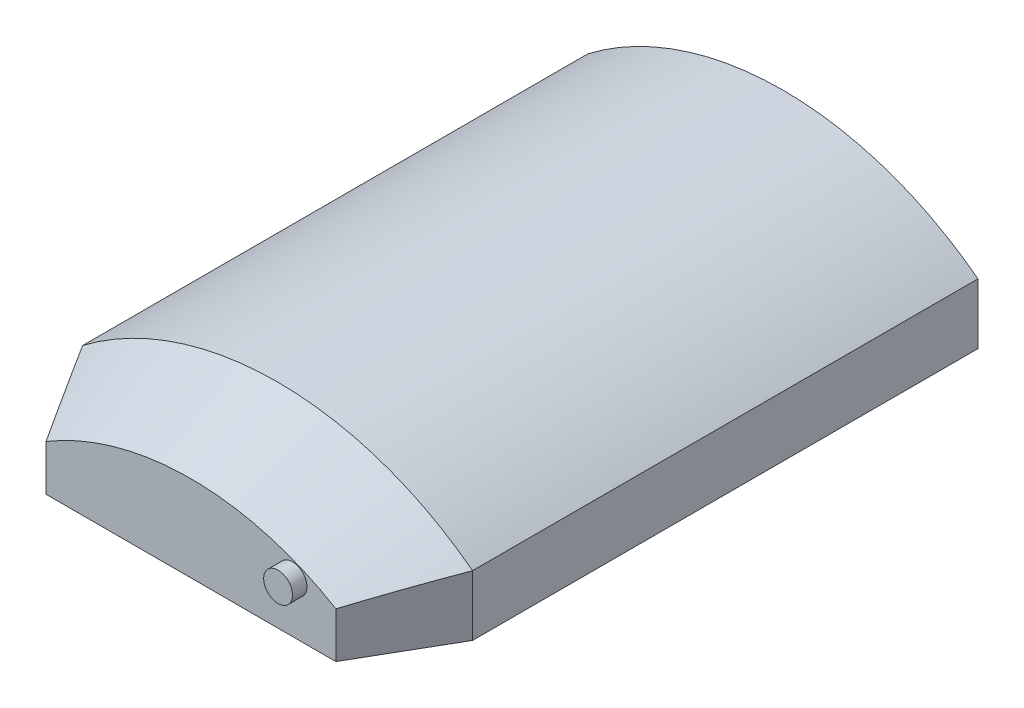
ISO-10303-21;
HEADER;
FILE_DESCRIPTION(('STEP AP214'),'2;1');
FILE_NAME('part.step','',(''),(''),'','','');
FILE_SCHEMA(('AUTOMOTIVE_DESIGN { 1 0 10303 214 1 1 1 1 }'));
ENDSEC;
DATA;
#1=APPLICATION_CONTEXT('core data for automotive mechanical design processes');
#2=APPLICATION_PROTOCOL_DEFINITION('international standard','automotive_design',2000,#1);
#3=PRODUCT_CONTEXT('',#1,'mechanical');
#4=PRODUCT('Part','Part','',(#3));
#5=PRODUCT_RELATED_PRODUCT_CATEGORY('part','',(#4));
#6=PRODUCT_DEFINITION_FORMATION('','',#4);
#7=PRODUCT_DEFINITION_CONTEXT('part definition',#1,'design');
#8=PRODUCT_DEFINITION('design','',#6,#7);
#9=PRODUCT_DEFINITION_SHAPE('','',#8);
#10=(LENGTH_UNIT() NAMED_UNIT(*) SI_UNIT(.MILLI.,.METRE.));
#11=(NAMED_UNIT(*) PLANE_ANGLE_UNIT() SI_UNIT($,.RADIAN.));
#12=(NAMED_UNIT(*) SI_UNIT($,.STERADIAN.) SOLID_ANGLE_UNIT());
#13=UNCERTAINTY_MEASURE_WITH_UNIT(LENGTH_MEASURE(1.E-05),#10,'distance_accuracy_value','');
#14=(GEOMETRIC_REPRESENTATION_CONTEXT(3) GLOBAL_UNCERTAINTY_ASSIGNED_CONTEXT((#13)) GLOBAL_UNIT_ASSIGNED_CONTEXT((#10,
#11,#12)) REPRESENTATION_CONTEXT('',''));
#15=CARTESIAN_POINT('',(0.,0.,0.));
#16=DIRECTION('',(0.,0.,1.));
#17=DIRECTION('',(1.,0.,0.));
#18=AXIS2_PLACEMENT_3D('',#15,#16,#17);
#19=CARTESIAN_POINT('',(0.,0.,260.35));
#20=DIRECTION('',(0.,0.,-1.));
#21=DIRECTION('',(-1.,0.,0.));
#22=AXIS2_PLACEMENT_3D('',#19,#20,#21);
#23=CYLINDRICAL_SURFACE('',#22,141.2875);
#24=DIRECTION('',(0.,0.,-1.));
#25=VECTOR('',#24,1.);
#26=CARTESIAN_POINT('',(-85.725,112.309314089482,260.35));
#27=LINE('',#26,#25);
#28=CARTESIAN_POINT('',(-85.725,112.309314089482,222.25));
#29=VERTEX_POINT('',#28);
#30=CARTESIAN_POINT('',(-85.725,112.309314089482,0.));
#31=VERTEX_POINT('',#30);
#32=EDGE_CURVE('E144',#29,#31,#27,.T.);
#33=ORIENTED_EDGE('',*,*,#32,.F.);
#34=CARTESIAN_POINT('',(0.,0.,222.25));
#35=DIRECTION('',(0.,0.,1.));
#36=DIRECTION('',(1.,0.,0.));
#37=AXIS2_PLACEMENT_3D('',#34,#35,#36);
#38=CIRCLE('',#37,141.2875);
#39=CARTESIAN_POINT('',(85.725,112.309314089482,222.25));
#40=VERTEX_POINT('',#39);
#41=EDGE_CURVE('E149',#29,#40,#38,.F.);
#42=ORIENTED_EDGE('',*,*,#41,.T.);
#43=DIRECTION('',(0.,0.,-1.));
#44=VECTOR('',#43,1.);
#45=CARTESIAN_POINT('',(85.725,112.309314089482,260.35));
#46=LINE('',#45,#44);
#47=CARTESIAN_POINT('',(85.725,112.309314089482,0.));
#48=VERTEX_POINT('',#47);
#49=EDGE_CURVE('E115',#40,#48,#46,.T.);
#50=ORIENTED_EDGE('',*,*,#49,.T.);
#51=CARTESIAN_POINT('',(0.,0.,0.));
#52=DIRECTION('',(0.,0.,1.));
#53=DIRECTION('',(1.,0.,0.));
#54=AXIS2_PLACEMENT_3D('',#51,#52,#53);
#55=CIRCLE('',#54,141.2875);
#56=EDGE_CURVE('E129',#48,#31,#55,.T.);
#57=ORIENTED_EDGE('',*,*,#56,.T.);
#58=EDGE_LOOP('',(#33,#42,#50,#57));
#59=FACE_BOUND('',#58,.T.);
#60=ADVANCED_FACE('F42',(#59),#23,.T.);
#61=CARTESIAN_POINT('',(-85.725,112.309314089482,260.35));
#62=DIRECTION('',(1.,0.,0.));
#63=DIRECTION('',(0.,0.,-1.));
#64=AXIS2_PLACEMENT_3D('',#61,#62,#63);
#65=PLANE('',#64);
#66=DIRECTION('',(0.,0.,-1.));
#67=VECTOR('',#66,1.);
#68=CARTESIAN_POINT('',(-85.725,85.725,260.35));
#69=LINE('',#68,#67);
#70=CARTESIAN_POINT('',(-85.725,85.725,222.25));
#71=VERTEX_POINT('',#70);
#72=CARTESIAN_POINT('',(-85.725,85.725,0.));
#73=VERTEX_POINT('',#72);
#74=EDGE_CURVE('E141',#71,#73,#69,.T.);
#75=ORIENTED_EDGE('',*,*,#74,.F.);
#76=DIRECTION('',(0.,-1.,0.));
#77=VECTOR('',#76,1.);
#78=CARTESIAN_POINT('',(-85.725,141.2875,222.25));
#79=LINE('',#78,#77);
#80=EDGE_CURVE('E127',#29,#71,#79,.T.);
#81=ORIENTED_EDGE('',*,*,#80,.F.);
#82=ORIENTED_EDGE('',*,*,#32,.T.);
#83=DIRECTION('',(0.,-1.,0.));
#84=VECTOR('',#83,1.);
#85=CARTESIAN_POINT('',(-85.725,112.309314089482,0.));
#86=LINE('',#85,#84);
#87=EDGE_CURVE('E133',#31,#73,#86,.T.);
#88=ORIENTED_EDGE('',*,*,#87,.T.);
#89=EDGE_LOOP('',(#75,#81,#82,#88));
#90=FACE_BOUND('',#89,.T.);
#91=ADVANCED_FACE('F163',(#90),#65,.F.);
#92=CARTESIAN_POINT('',(-85.725,85.725,260.35));
#93=DIRECTION('',(0.,1.,0.));
#94=DIRECTION('',(0.,0.,1.));
#95=AXIS2_PLACEMENT_3D('',#92,#93,#94);
#96=PLANE('',#95);
#97=DIRECTION('',(0.,0.,-1.));
#98=VECTOR('',#97,1.);
#99=CARTESIAN_POINT('',(85.725,85.725,260.35));
#100=LINE('',#99,#98);
#101=CARTESIAN_POINT('',(85.725,85.725,222.25));
#102=VERTEX_POINT('',#101);
#103=CARTESIAN_POINT('',(85.725,85.725,0.));
#104=VERTEX_POINT('',#103);
#105=EDGE_CURVE('E108',#102,#104,#100,.T.);
#106=ORIENTED_EDGE('',*,*,#105,.F.);
#107=DIRECTION('',(0.499999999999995,0.,-0.866025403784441));
#108=VECTOR('',#107,1.);
#109=CARTESIAN_POINT('',(85.725,85.725,222.25));
#110=LINE('',#109,#108);
#111=CARTESIAN_POINT('',(63.7279547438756,85.725,260.35));
#112=VERTEX_POINT('',#111);
#113=EDGE_CURVE('E97',#112,#102,#110,.T.);
#114=ORIENTED_EDGE('',*,*,#113,.F.);
#115=DIRECTION('',(1.,0.,0.));
#116=VECTOR('',#115,1.);
#117=CARTESIAN_POINT('',(-85.725,85.725,260.35));
#118=LINE('',#117,#116);
#119=CARTESIAN_POINT('',(-63.7279547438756,85.725,260.35));
#120=VERTEX_POINT('',#119);
#121=EDGE_CURVE('E106',#120,#112,#118,.T.);
#122=ORIENTED_EDGE('',*,*,#121,.F.);
#123=DIRECTION('',(0.499999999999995,0.,0.866025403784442));
#124=VECTOR('',#123,1.);
#125=CARTESIAN_POINT('',(-63.7279547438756,85.725,260.35));
#126=LINE('',#125,#124);
#127=EDGE_CURVE('E166',#71,#120,#126,.T.);
#128=ORIENTED_EDGE('',*,*,#127,.F.);
#129=ORIENTED_EDGE('',*,*,#74,.T.);
#130=DIRECTION('',(1.,0.,0.));
#131=VECTOR('',#130,1.);
#132=CARTESIAN_POINT('',(-85.725,85.725,0.));
#133=LINE('',#132,#131);
#134=EDGE_CURVE('E123',#73,#104,#133,.T.);
#135=ORIENTED_EDGE('',*,*,#134,.T.);
#136=EDGE_LOOP('',(#106,#114,#122,#128,#129,#135));
#137=FACE_BOUND('',#136,.T.);
#138=ADVANCED_FACE('F104',(#137),#96,.F.);
#139=CARTESIAN_POINT('',(85.725,85.725,260.35));
#140=DIRECTION('',(-1.,0.,0.));
#141=DIRECTION('',(0.,0.,1.));
#142=AXIS2_PLACEMENT_3D('',#139,#140,#141);
#143=PLANE('',#142);
#144=ORIENTED_EDGE('',*,*,#49,.F.);
#145=DIRECTION('',(0.,-1.,0.));
#146=VECTOR('',#145,1.);
#147=CARTESIAN_POINT('',(85.725,141.2875,222.25));
#148=LINE('',#147,#146);
#149=EDGE_CURVE('E65',#40,#102,#148,.T.);
#150=ORIENTED_EDGE('',*,*,#149,.T.);
#151=ORIENTED_EDGE('',*,*,#105,.T.);
#152=DIRECTION('',(0.,1.,0.));
#153=VECTOR('',#152,1.);
#154=CARTESIAN_POINT('',(85.725,85.725,0.));
#155=LINE('',#154,#153);
#156=EDGE_CURVE('E116',#104,#48,#155,.T.);
#157=ORIENTED_EDGE('',*,*,#156,.T.);
#158=EDGE_LOOP('',(#144,#150,#151,#157));
#159=FACE_BOUND('',#158,.T.);
#160=ADVANCED_FACE('F187',(#159),#143,.F.);
#161=CARTESIAN_POINT('',(0.,0.,260.35));
#162=DIRECTION('',(0.,0.,1.));
#163=DIRECTION('',(1.,0.,0.));
#164=AXIS2_PLACEMENT_3D('',#161,#162,#163);
#165=PLANE('',#164);
#166=CARTESIAN_POINT('',(44.67352,107.852355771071,260.35));
#167=DIRECTION('',(0.,0.,1.));
#168=DIRECTION('',(1.,0.,0.));
#169=AXIS2_PLACEMENT_3D('',#166,#167,#168);
#170=CIRCLE('',#169,6.35);
#171=CARTESIAN_POINT('',(51.02352,107.852355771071,260.35));
#172=VERTEX_POINT('',#171);
#173=EDGE_CURVE('E207',#172,#172,#170,.T.);
#174=ORIENTED_EDGE('',*,*,#173,.F.);
#175=EDGE_LOOP('',(#174));
#176=FACE_BOUND('',#175,.T.);
#177=DIRECTION('',(0.,-1.,0.));
#178=VECTOR('',#177,1.);
#179=CARTESIAN_POINT('',(63.7279547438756,141.2875,260.35));
#180=LINE('',#179,#178);
#181=CARTESIAN_POINT('',(63.7279547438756,105.812235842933,260.35));
#182=VERTEX_POINT('',#181);
#183=EDGE_CURVE('E94',#182,#112,#180,.T.);
#184=ORIENTED_EDGE('',*,*,#183,.F.);
#185=CARTESIAN_POINT('',(0.,0.,260.35));
#186=DIRECTION('',(0.,0.,1.));
#187=DIRECTION('',(1.,0.,0.));
#188=AXIS2_PLACEMENT_3D('',#185,#186,#187);
#189=CIRCLE('',#188,123.521178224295);
#190=CARTESIAN_POINT('',(-63.7279547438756,105.812235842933,260.35));
#191=VERTEX_POINT('',#190);
#192=EDGE_CURVE('E58',#182,#191,#189,.T.);
#193=ORIENTED_EDGE('',*,*,#192,.T.);
#194=DIRECTION('',(0.,-1.,0.));
#195=VECTOR('',#194,1.);
#196=CARTESIAN_POINT('',(-63.7279547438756,141.2875,260.35));
#197=LINE('',#196,#195);
#198=EDGE_CURVE('E113',#191,#120,#197,.T.);
#199=ORIENTED_EDGE('',*,*,#198,.T.);
#200=ORIENTED_EDGE('',*,*,#121,.T.);
#201=EDGE_LOOP('',(#184,#193,#199,#200));
#202=FACE_BOUND('',#201,.T.);
#203=ADVANCED_FACE('F112',(#176,#202),#165,.T.);
#204=CARTESIAN_POINT('',(0.,0.,0.));
#205=DIRECTION('',(0.,0.,1.));
#206=DIRECTION('',(1.,0.,0.));
#207=AXIS2_PLACEMENT_3D('',#204,#205,#206);
#208=PLANE('',#207);
#209=ORIENTED_EDGE('',*,*,#56,.F.);
#210=ORIENTED_EDGE('',*,*,#156,.F.);
#211=ORIENTED_EDGE('',*,*,#134,.F.);
#212=ORIENTED_EDGE('',*,*,#87,.F.);
#213=EDGE_LOOP('',(#209,#210,#211,#212));
#214=FACE_BOUND('',#213,.T.);
#215=ADVANCED_FACE('F171',(#214),#208,.F.);
#216=CARTESIAN_POINT('',(0.,0.,260.35));
#217=DIRECTION('',(0.,0.,-1.));
#218=DIRECTION('',(-1.,0.,0.));
#219=AXIS2_PLACEMENT_3D('',#216,#217,#218);
#220=CONICAL_SURFACE('',#219,123.521178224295,0.436332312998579);
#221=CARTESIAN_POINT('',(167.378143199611,0.,80.8226073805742));
#222=DIRECTION('',(-0.866025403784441,0.,-0.499999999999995));
#223=DIRECTION('',(0.499999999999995,0.,-0.866025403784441));
#224=AXIS2_PLACEMENT_3D('',#221,#222,#223);
#225=ELLIPSE('',#224,414.472352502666,122.194066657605);
#226=EDGE_CURVE('E11',#40,#182,#225,.F.);
#227=ORIENTED_EDGE('',*,*,#226,.F.);
#228=ORIENTED_EDGE('',*,*,#41,.F.);
#229=CARTESIAN_POINT('',(-167.378143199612,0.,80.8226073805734));
#230=DIRECTION('',(0.866025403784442,0.,-0.499999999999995));
#231=DIRECTION('',(-0.499999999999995,0.,-0.866025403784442));
#232=AXIS2_PLACEMENT_3D('',#229,#230,#231);
#233=ELLIPSE('',#232,414.472352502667,122.194066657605);
#234=EDGE_CURVE('E51',#191,#29,#233,.F.);
#235=ORIENTED_EDGE('',*,*,#234,.F.);
#236=ORIENTED_EDGE('',*,*,#192,.F.);
#237=EDGE_LOOP('',(#227,#228,#235,#236));
#238=FACE_BOUND('',#237,.T.);
#239=ADVANCED_FACE('F44',(#238),#220,.T.);
#240=CARTESIAN_POINT('',(-63.7279547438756,141.2875,260.35));
#241=DIRECTION('',(0.866025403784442,0.,-0.499999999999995));
#242=DIRECTION('',(-0.499999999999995,0.,-0.866025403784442));
#243=AXIS2_PLACEMENT_3D('',#240,#241,#242);
#244=PLANE('',#243);
#245=ORIENTED_EDGE('',*,*,#234,.T.);
#246=ORIENTED_EDGE('',*,*,#80,.T.);
#247=ORIENTED_EDGE('',*,*,#127,.T.);
#248=ORIENTED_EDGE('',*,*,#198,.F.);
#249=EDGE_LOOP('',(#245,#246,#247,#248));
#250=FACE_BOUND('',#249,.T.);
#251=ADVANCED_FACE('F157',(#250),#244,.F.);
#252=CARTESIAN_POINT('',(85.725,141.2875,222.25));
#253=DIRECTION('',(-0.866025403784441,0.,-0.499999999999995));
#254=DIRECTION('',(-0.499999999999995,0.,0.866025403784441));
#255=AXIS2_PLACEMENT_3D('',#252,#253,#254);
#256=PLANE('',#255);
#257=ORIENTED_EDGE('',*,*,#226,.T.);
#258=ORIENTED_EDGE('',*,*,#183,.T.);
#259=ORIENTED_EDGE('',*,*,#113,.T.);
#260=ORIENTED_EDGE('',*,*,#149,.F.);
#261=EDGE_LOOP('',(#257,#258,#259,#260));
#262=FACE_BOUND('',#261,.T.);
#263=ADVANCED_FACE('F96',(#262),#256,.F.);
#264=CARTESIAN_POINT('',(44.67352,107.852355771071,266.7));
#265=DIRECTION('',(0.,0.,-1.));
#266=DIRECTION('',(-1.,0.,0.));
#267=AXIS2_PLACEMENT_3D('',#264,#265,#266);
#268=CYLINDRICAL_SURFACE('',#267,6.35);
#269=CARTESIAN_POINT('',(44.67352,107.852355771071,266.7));
#270=DIRECTION('',(0.,0.,1.));
#271=DIRECTION('',(1.,0.,0.));
#272=AXIS2_PLACEMENT_3D('',#269,#270,#271);
#273=CIRCLE('',#272,6.35);
#274=CARTESIAN_POINT('',(51.02352,107.852355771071,266.7));
#275=VERTEX_POINT('',#274);
#276=EDGE_CURVE('E110',#275,#275,#273,.T.);
#277=ORIENTED_EDGE('',*,*,#276,.F.);
#278=EDGE_LOOP('',(#277));
#279=FACE_BOUND('',#278,.T.);
#280=ORIENTED_EDGE('',*,*,#173,.T.);
#281=EDGE_LOOP('',(#280));
#282=FACE_BOUND('',#281,.T.);
#283=ADVANCED_FACE('F196',(#279,#282),#268,.T.);
#284=CARTESIAN_POINT('',(44.67352,107.852355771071,266.7));
#285=DIRECTION('',(0.,0.,1.));
#286=DIRECTION('',(1.,0.,0.));
#287=AXIS2_PLACEMENT_3D('',#284,#285,#286);
#288=PLANE('',#287);
#289=ORIENTED_EDGE('',*,*,#276,.T.);
#290=EDGE_LOOP('',(#289));
#291=FACE_BOUND('',#290,.T.);
#292=ADVANCED_FACE('F199',(#291),#288,.T.);
#293=CLOSED_SHELL('',(#60,#91,#138,#160,#203,#215,#239,#251,#263,#283,#292));
#294=MANIFOLD_SOLID_BREP('B2',#293);
#295=ADVANCED_BREP_SHAPE_REPRESENTATION('',(#18,#294),#14);
#296=SHAPE_DEFINITION_REPRESENTATION(#9,#295);
ENDSEC;
END-ISO-10303-21;
